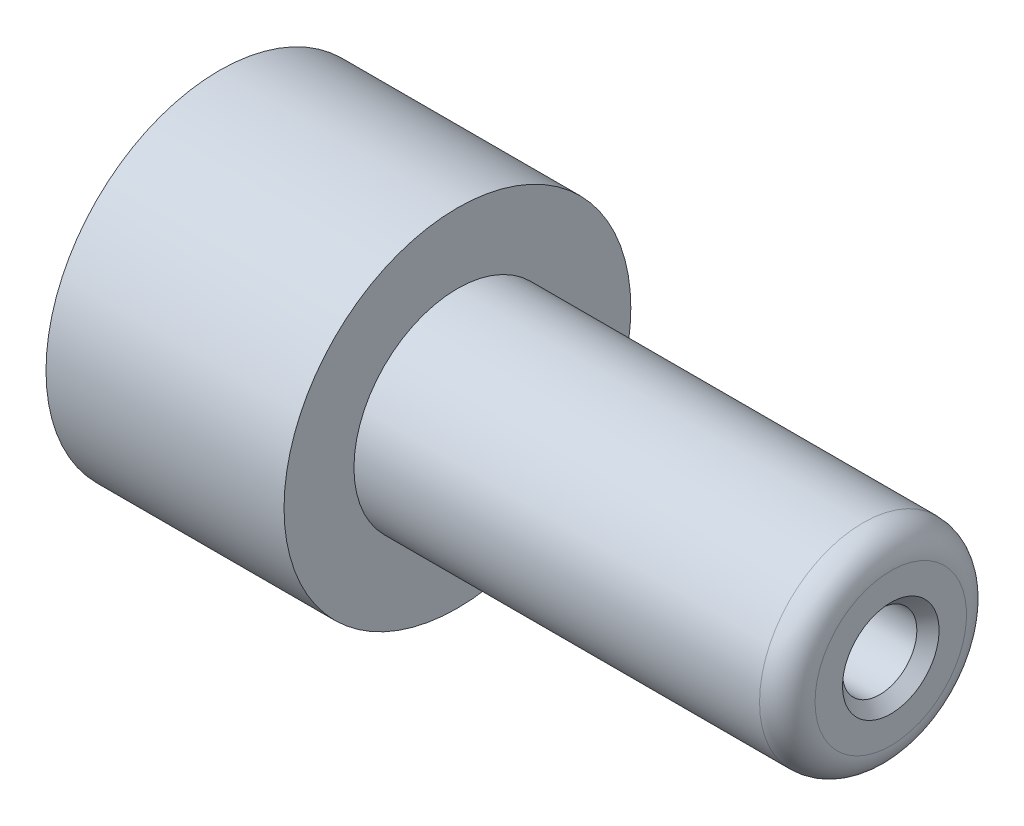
from build123d import *

# Parameters (mm, degrees)
SKETCH2_R          = 1.1811
CUT_EXTRUDE1_DEPTH = 2.3622
SKETCH3_R          = 1.7018
CUT_EXTRUDE2_DEPTH = 33.7198192
CHAMFER1_SIZE      = 0.508


with BuildPart() as part:
    # Sketch1 → Revolve1 (revolve)
    with BuildSketch(Plane.XY, mode=Mode.PRIVATE) as revolve1_sk:
        with BuildLine():
            Line((0, 3.5687), (0, 7.9375))
            Line((0, 7.9375), (10.8966, 7.9375))
            Line((10.8966, 7.9375), (10.8966, 4.7371))
            Line((10.8966, 4.7371), (29.464, 4.7371))
            ThreePointArc((29.464, 4.7371), (30.362025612, 4.365125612), (30.734, 3.4671))
            Line((30.734, 3.4671), (30.734, 0))
            Line((30.734, 0), (24.4856, 0))
            Line((24.4856, 0), (24.4856, 3.5687))
            Line((24.4856, 3.5687), (0, 3.5687))
        make_face()
    revolve(revolve1_sk.sketch.rotate(Axis((0, 0, 0), (1, 0, 0)), 90), axis=Axis((0, 0, 0), (1, 0, 0)))

    # Sketch2 → Cut-Extrude1 (cut)
    with BuildSketch(Plane.ZY):
        with Locations((-5.5499, 0)):
            Circle(SKETCH2_R)
        with Locations(Location((5.5499, 0, 0), (0, 0, 180))):
            Circle(SKETCH2_R)
    extrude(amount=-CUT_EXTRUDE1_DEPTH, mode=Mode.SUBTRACT)

    # Sketch3 → Cut-Extrude2 (cut, through all)
    with BuildSketch(Plane(origin=(30.734, 0, 0), x_dir=(0, 0, -1), z_dir=(1, 0, 0))):
        Circle(SKETCH3_R)
    extrude(amount=-CUT_EXTRUDE2_DEPTH, mode=Mode.SUBTRACT)

    # Chamfer1
    chamfer1_edges = [part.edges().sort_by_distance(p)[0] for p in [
        (30.734, 0, 1.7018),
    ]]
    chamfer(chamfer1_edges, length=CHAMFER1_SIZE)


solid = part.part
